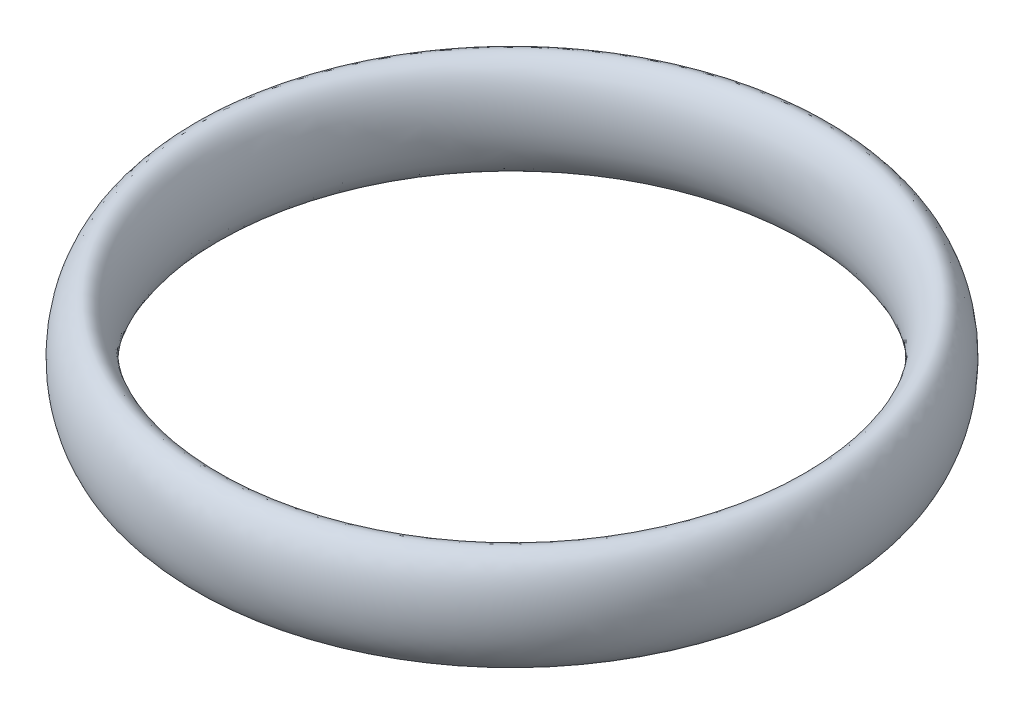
ISO-10303-21;
HEADER;
FILE_DESCRIPTION(('STEP AP214'),'2;1');
FILE_NAME('part.step','',(''),(''),'','','');
FILE_SCHEMA(('AUTOMOTIVE_DESIGN { 1 0 10303 214 1 1 1 1 }'));
ENDSEC;
DATA;
#1=APPLICATION_CONTEXT('core data for automotive mechanical design processes');
#2=APPLICATION_PROTOCOL_DEFINITION('international standard','automotive_design',2000,#1);
#3=PRODUCT_CONTEXT('',#1,'mechanical');
#4=PRODUCT('Part','Part','',(#3));
#5=PRODUCT_RELATED_PRODUCT_CATEGORY('part','',(#4));
#6=PRODUCT_DEFINITION_FORMATION('','',#4);
#7=PRODUCT_DEFINITION_CONTEXT('part definition',#1,'design');
#8=PRODUCT_DEFINITION('design','',#6,#7);
#9=PRODUCT_DEFINITION_SHAPE('','',#8);
#10=(LENGTH_UNIT() NAMED_UNIT(*) SI_UNIT(.MILLI.,.METRE.));
#11=(NAMED_UNIT(*) PLANE_ANGLE_UNIT() SI_UNIT($,.RADIAN.));
#12=(NAMED_UNIT(*) SI_UNIT($,.STERADIAN.) SOLID_ANGLE_UNIT());
#13=UNCERTAINTY_MEASURE_WITH_UNIT(LENGTH_MEASURE(1.E-05),#10,'distance_accuracy_value','');
#14=(GEOMETRIC_REPRESENTATION_CONTEXT(3) GLOBAL_UNCERTAINTY_ASSIGNED_CONTEXT((#13)) GLOBAL_UNIT_ASSIGNED_CONTEXT((#10,
#11,#12)) REPRESENTATION_CONTEXT('',''));
#15=CARTESIAN_POINT('',(0.,0.,0.));
#16=DIRECTION('',(0.,0.,1.));
#17=DIRECTION('',(1.,0.,0.));
#18=AXIS2_PLACEMENT_3D('',#15,#16,#17);
#19=CARTESIAN_POINT('',(7.5692,1.26999999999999,0.));
#20=DIRECTION('',(0.,0.,1.));
#21=DIRECTION('',(0.,1.,0.));
#22=AXIS2_PLACEMENT_3D('',#19,#20,#21);
#23=ELLIPSE('',#22,1.27,0.635);
#24=CARTESIAN_POINT('',(0.,0.,0.));
#25=DIRECTION('',(0.,-1.,0.));
#26=AXIS1_PLACEMENT('',#24,#25);
#27=SURFACE_OF_REVOLUTION('',#23,#26);
#28=ADVANCED_FACE('F25',(),#27,.F.);
#29=CLOSED_SHELL('',(#28));
#30=MANIFOLD_SOLID_BREP('B2',#29);
#31=ADVANCED_BREP_SHAPE_REPRESENTATION('',(#18,#30),#14);
#32=SHAPE_DEFINITION_REPRESENTATION(#9,#31);
ENDSEC;
END-ISO-10303-21;
